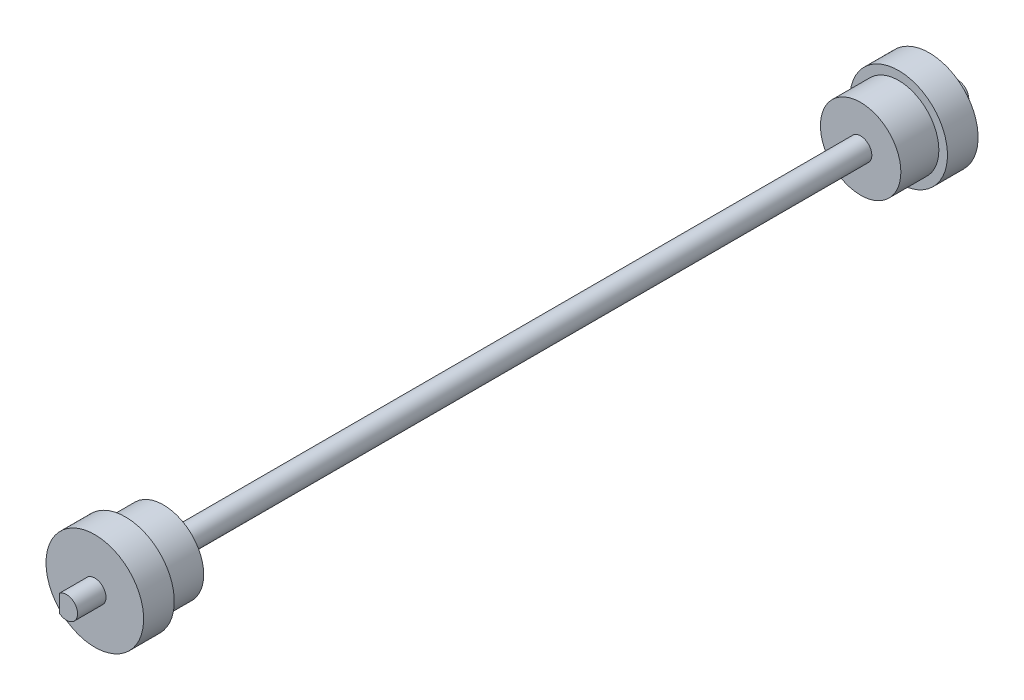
from build123d import *

# Parameters (mm, degrees)
BOSS_EXTRUDE1_DEPTH = 199.39
SKETCH2_R           = 10.922
SKETCH2_R_2         = 2.5
BOSS_EXTRUDE2_DEPTH = 6.858
SKETCH3_R           = 9
SKETCH3_R_2         = 2.5
BOSS_EXTRUDE3_DEPTH = 8.5


with BuildPart() as part:
    # Sketch1 → Boss-Extrude1 (new body)
    with BuildSketch(Plane.XY):
        with BuildLine():
            Line((-1.571215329, 1.944551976), (-1.571215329, -1.944551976))
            ThreePointArc((-1.571215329, -1.944551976), (2.5, 0), (-1.571215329, 1.944551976))
        make_face()
    extrude(amount=BOSS_EXTRUDE1_DEPTH)


with BuildPart() as body_2:
    # Sketch2 → Boss-Extrude2 (new body)
    with BuildSketch(Plane(origin=(0, 0, 6.35), x_dir=(-1, 0, 0), z_dir=(0, 0, -1))):
        Circle(SKETCH2_R)
        Circle(SKETCH2_R_2, mode=Mode.SUBTRACT)
    boss_extrude2 = extrude(amount=-BOSS_EXTRUDE2_DEPTH)


with BuildPart() as body_3:
    # Sketch3 → Boss-Extrude3 (new body)
    with BuildSketch(Plane.XY.offset(13.208)):
        Circle(SKETCH3_R)
        Circle(SKETCH3_R_2, mode=Mode.SUBTRACT)
    boss_extrude3 = extrude(amount=BOSS_EXTRUDE3_DEPTH)


with BuildPart() as part_1:
    add(part.part)

    # Mirror2: Boss-Extrude2, Boss-Extrude3 across plane
    add(boss_extrude2.mirror(Plane(origin=(0, 0, 99.695), x_dir=(1, 0, 0), z_dir=(0, 0, -1))))
    add(boss_extrude3.mirror(Plane(origin=(0, 0, 99.695), x_dir=(1, 0, 0), z_dir=(0, 0, -1))))


solid = Compound([body_2.part, body_3.part, part_1.part])
